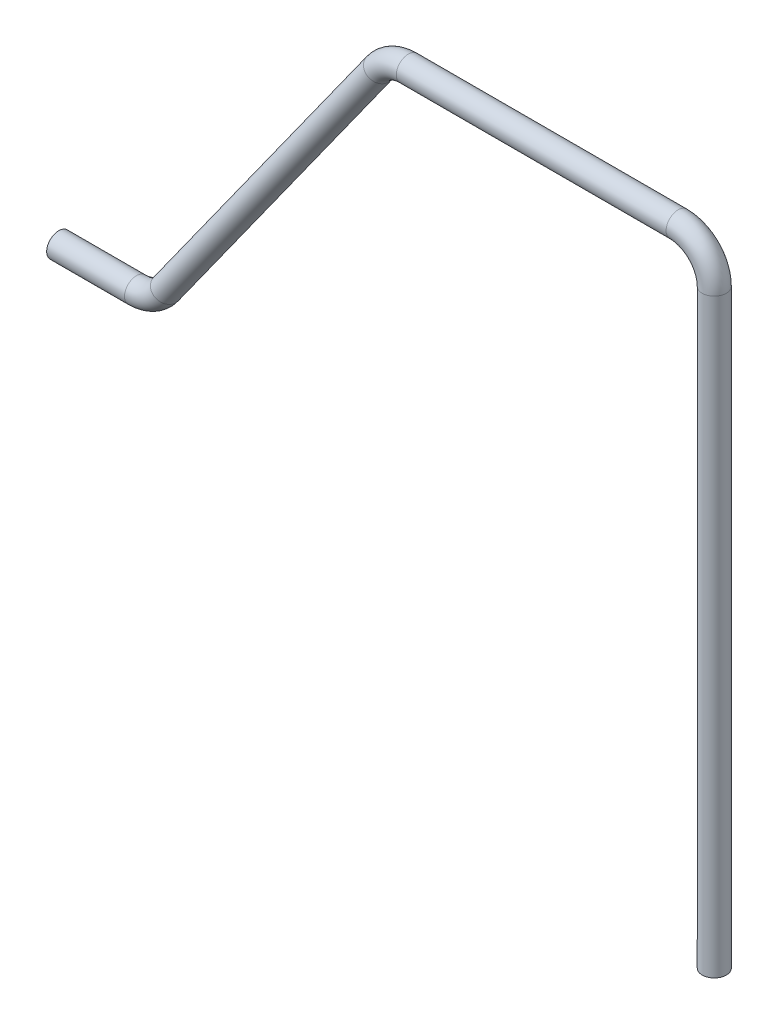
ISO-10303-21;
HEADER;
FILE_DESCRIPTION(('STEP AP214'),'2;1');
FILE_NAME('part.step','',(''),(''),'','','');
FILE_SCHEMA(('AUTOMOTIVE_DESIGN { 1 0 10303 214 1 1 1 1 }'));
ENDSEC;
DATA;
#1=APPLICATION_CONTEXT('core data for automotive mechanical design processes');
#2=APPLICATION_PROTOCOL_DEFINITION('international standard','automotive_design',2000,#1);
#3=PRODUCT_CONTEXT('',#1,'mechanical');
#4=PRODUCT('Part','Part','',(#3));
#5=PRODUCT_RELATED_PRODUCT_CATEGORY('part','',(#4));
#6=PRODUCT_DEFINITION_FORMATION('','',#4);
#7=PRODUCT_DEFINITION_CONTEXT('part definition',#1,'design');
#8=PRODUCT_DEFINITION('design','',#6,#7);
#9=PRODUCT_DEFINITION_SHAPE('','',#8);
#10=(LENGTH_UNIT() NAMED_UNIT(*) SI_UNIT(.MILLI.,.METRE.));
#11=(NAMED_UNIT(*) PLANE_ANGLE_UNIT() SI_UNIT($,.RADIAN.));
#12=(NAMED_UNIT(*) SI_UNIT($,.STERADIAN.) SOLID_ANGLE_UNIT());
#13=UNCERTAINTY_MEASURE_WITH_UNIT(LENGTH_MEASURE(1.E-05),#10,'distance_accuracy_value','');
#14=(GEOMETRIC_REPRESENTATION_CONTEXT(3) GLOBAL_UNCERTAINTY_ASSIGNED_CONTEXT((#13)) GLOBAL_UNIT_ASSIGNED_CONTEXT((#10,
#11,#12)) REPRESENTATION_CONTEXT('',''));
#15=CARTESIAN_POINT('',(0.,0.,0.));
#16=DIRECTION('',(0.,0.,1.));
#17=DIRECTION('',(1.,0.,0.));
#18=AXIS2_PLACEMENT_3D('',#15,#16,#17);
#19=CARTESIAN_POINT('',(86.36,38.4175,0.));
#20=DIRECTION('',(0.,-1.,0.));
#21=DIRECTION('',(1.,0.,0.));
#22=AXIS2_PLACEMENT_3D('',#19,#20,#21);
#23=CYLINDRICAL_SURFACE('',#22,1.5875);
#24=CARTESIAN_POINT('',(86.36,38.4175,0.));
#25=DIRECTION('',(0.,-1.,0.));
#26=DIRECTION('',(0.,0.,-1.));
#27=AXIS2_PLACEMENT_3D('',#24,#25,#26);
#28=CIRCLE('',#27,1.5875);
#29=CARTESIAN_POINT('',(87.9475,38.4175,0.));
#30=VERTEX_POINT('',#29);
#31=EDGE_CURVE('E38',#30,#30,#28,.T.);
#32=ORIENTED_EDGE('',*,*,#31,.T.);
#33=EDGE_LOOP('',(#32));
#34=FACE_BOUND('',#33,.T.);
#35=CARTESIAN_POINT('',(86.36,-39.37,0.));
#36=DIRECTION('',(0.,-1.,0.));
#37=DIRECTION('',(0.,0.,-1.));
#38=AXIS2_PLACEMENT_3D('',#35,#36,#37);
#39=CIRCLE('',#38,1.5875);
#40=CARTESIAN_POINT('',(86.36,-39.37,-1.5875));
#41=VERTEX_POINT('',#40);
#42=EDGE_CURVE('E10',#41,#41,#39,.T.);
#43=ORIENTED_EDGE('',*,*,#42,.F.);
#44=EDGE_LOOP('',(#43));
#45=FACE_BOUND('',#44,.T.);
#46=ADVANCED_FACE('F32',(#34,#45),#23,.T.);
#47=CARTESIAN_POINT('',(81.5975,38.4175,0.));
#48=DIRECTION('',(0.,0.,-1.));
#49=DIRECTION('',(-1.,0.,0.));
#50=AXIS2_PLACEMENT_3D('',#47,#48,#49);
#51=TOROIDAL_SURFACE('',#50,4.7625,1.5875);
#52=CARTESIAN_POINT('',(81.5975,43.18,0.));
#53=DIRECTION('',(1.,0.,0.));
#54=DIRECTION('',(0.,0.,-1.));
#55=AXIS2_PLACEMENT_3D('',#52,#53,#54);
#56=CIRCLE('',#55,1.5875);
#57=CARTESIAN_POINT('',(81.5975,44.7675,0.));
#58=VERTEX_POINT('',#57);
#59=EDGE_CURVE('E42',#58,#58,#56,.T.);
#60=CARTESIAN_POINT('',(81.5975,38.4175,0.));
#61=DIRECTION('',(0.,0.,-1.));
#62=DIRECTION('',(-1.,0.,0.));
#63=AXIS2_PLACEMENT_3D('',#60,#61,#62);
#64=CIRCLE('',#63,6.35);
#65=EDGE_CURVE('',#58,#30,#64,.T.);
#66=ORIENTED_EDGE('',*,*,#59,.T.);
#67=ORIENTED_EDGE('',*,*,#31,.F.);
#68=ORIENTED_EDGE('',*,*,#65,.T.);
#69=ORIENTED_EDGE('',*,*,#65,.F.);
#70=EDGE_LOOP('',(#66,#68,#67,#69));
#71=FACE_BOUND('',#70,.T.);
#72=ADVANCED_FACE('F82',(#71),#51,.T.);
#73=CARTESIAN_POINT('',(46.0573254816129,43.18,0.));
#74=DIRECTION('',(1.,0.,0.));
#75=DIRECTION('',(0.,1.,0.));
#76=AXIS2_PLACEMENT_3D('',#73,#74,#75);
#77=CYLINDRICAL_SURFACE('',#76,1.5875);
#78=CARTESIAN_POINT('',(46.0573254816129,43.18,0.));
#79=DIRECTION('',(1.,0.,0.));
#80=DIRECTION('',(0.,0.,-1.));
#81=AXIS2_PLACEMENT_3D('',#78,#79,#80);
#82=CIRCLE('',#81,1.5875);
#83=CARTESIAN_POINT('',(46.0573254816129,44.7675,0.));
#84=VERTEX_POINT('',#83);
#85=EDGE_CURVE('E46',#84,#84,#82,.T.);
#86=ORIENTED_EDGE('',*,*,#85,.T.);
#87=EDGE_LOOP('',(#86));
#88=FACE_BOUND('',#87,.T.);
#89=ORIENTED_EDGE('',*,*,#59,.F.);
#90=EDGE_LOOP('',(#89));
#91=FACE_BOUND('',#90,.T.);
#92=ADVANCED_FACE('F86',(#88,#91),#77,.T.);
#93=CARTESIAN_POINT('',(46.0573254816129,38.4175,0.));
#94=DIRECTION('',(0.,0.,-1.));
#95=DIRECTION('',(-1.,0.,0.));
#96=AXIS2_PLACEMENT_3D('',#93,#94,#95);
#97=TOROIDAL_SURFACE('',#96,4.7625,1.5875);
#98=CARTESIAN_POINT('',(42.1847501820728,41.1896051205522,0.));
#99=DIRECTION('',(0.582069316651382,0.813139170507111,0.));
#100=DIRECTION('',(0.,0.,-1.));
#101=AXIS2_PLACEMENT_3D('',#98,#99,#100);
#102=CIRCLE('',#101,1.5875);
#103=CARTESIAN_POINT('',(40.8938917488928,42.1136401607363,0.));
#104=VERTEX_POINT('',#103);
#105=EDGE_CURVE('E51',#104,#104,#102,.T.);
#106=CARTESIAN_POINT('',(46.0573254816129,38.4175,0.));
#107=DIRECTION('',(0.,0.,-1.));
#108=DIRECTION('',(-1.,0.,0.));
#109=AXIS2_PLACEMENT_3D('',#106,#107,#108);
#110=CIRCLE('',#109,6.35);
#111=EDGE_CURVE('',#104,#84,#110,.T.);
#112=ORIENTED_EDGE('',*,*,#105,.T.);
#113=ORIENTED_EDGE('',*,*,#85,.F.);
#114=ORIENTED_EDGE('',*,*,#111,.T.);
#115=ORIENTED_EDGE('',*,*,#111,.F.);
#116=EDGE_LOOP('',(#112,#114,#113,#115));
#117=FACE_BOUND('',#116,.T.);
#118=ADVANCED_FACE('F92',(#117),#97,.T.);
#119=CARTESIAN_POINT('',(14.1247841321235,1.9903948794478,0.));
#120=DIRECTION('',(0.582069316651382,0.813139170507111,0.));
#121=DIRECTION('',(-0.813139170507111,0.582069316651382,0.));
#122=AXIS2_PLACEMENT_3D('',#119,#120,#121);
#123=CYLINDRICAL_SURFACE('',#122,1.5875);
#124=CARTESIAN_POINT('',(14.1247841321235,1.9903948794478,0.));
#125=DIRECTION('',(0.582069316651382,0.813139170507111,0.));
#126=DIRECTION('',(0.,0.,-1.));
#127=AXIS2_PLACEMENT_3D('',#124,#125,#126);
#128=CIRCLE('',#127,1.5875);
#129=CARTESIAN_POINT('',(15.4156425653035,1.06635983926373,0.));
#130=VERTEX_POINT('',#129);
#131=EDGE_CURVE('E54',#130,#130,#128,.T.);
#132=ORIENTED_EDGE('',*,*,#131,.T.);
#133=EDGE_LOOP('',(#132));
#134=FACE_BOUND('',#133,.T.);
#135=ORIENTED_EDGE('',*,*,#105,.F.);
#136=EDGE_LOOP('',(#135));
#137=FACE_BOUND('',#136,.T.);
#138=ADVANCED_FACE('F99',(#134,#137),#123,.T.);
#139=CARTESIAN_POINT('',(10.2522088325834,4.7625,0.));
#140=DIRECTION('',(0.,0.,1.));
#141=DIRECTION('',(1.,0.,0.));
#142=AXIS2_PLACEMENT_3D('',#139,#140,#141);
#143=TOROIDAL_SURFACE('',#142,4.7625,1.5875);
#144=CARTESIAN_POINT('',(10.2522088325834,0.,0.));
#145=DIRECTION('',(1.,0.,0.));
#146=DIRECTION('',(0.,0.,-1.));
#147=AXIS2_PLACEMENT_3D('',#144,#145,#146);
#148=CIRCLE('',#147,1.5875);
#149=CARTESIAN_POINT('',(10.2522088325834,-1.5875,0.));
#150=VERTEX_POINT('',#149);
#151=EDGE_CURVE('E57',#150,#150,#148,.T.);
#152=CARTESIAN_POINT('',(10.2522088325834,4.7625,0.));
#153=DIRECTION('',(0.,0.,1.));
#154=DIRECTION('',(1.,0.,0.));
#155=AXIS2_PLACEMENT_3D('',#152,#153,#154);
#156=CIRCLE('',#155,6.35);
#157=EDGE_CURVE('',#150,#130,#156,.T.);
#158=ORIENTED_EDGE('',*,*,#151,.T.);
#159=ORIENTED_EDGE('',*,*,#131,.F.);
#160=ORIENTED_EDGE('',*,*,#157,.T.);
#161=ORIENTED_EDGE('',*,*,#157,.F.);
#162=EDGE_LOOP('',(#158,#160,#159,#161));
#163=FACE_BOUND('',#162,.T.);
#164=ADVANCED_FACE('F64',(#163),#143,.T.);
#165=CARTESIAN_POINT('',(10.2522088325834,0.,0.));
#166=DIRECTION('',(-1.,0.,0.));
#167=DIRECTION('',(0.,-1.,0.));
#168=AXIS2_PLACEMENT_3D('',#165,#166,#167);
#169=CYLINDRICAL_SURFACE('',#168,1.5875);
#170=ORIENTED_EDGE('',*,*,#151,.F.);
#171=EDGE_LOOP('',(#170));
#172=FACE_BOUND('',#171,.T.);
#173=CARTESIAN_POINT('',(0.,0.,0.));
#174=DIRECTION('',(1.,0.,0.));
#175=DIRECTION('',(0.,0.,-1.));
#176=AXIS2_PLACEMENT_3D('',#173,#174,#175);
#177=CIRCLE('',#176,1.5875);
#178=CARTESIAN_POINT('',(0.,0.,-1.5875));
#179=VERTEX_POINT('',#178);
#180=EDGE_CURVE('E58',#179,#179,#177,.T.);
#181=ORIENTED_EDGE('',*,*,#180,.T.);
#182=EDGE_LOOP('',(#181));
#183=FACE_BOUND('',#182,.T.);
#184=ADVANCED_FACE('F67',(#172,#183),#169,.T.);
#185=CARTESIAN_POINT('',(86.36,-39.37,0.));
#186=DIRECTION('',(0.,-1.,0.));
#187=DIRECTION('',(0.,0.,-1.));
#188=AXIS2_PLACEMENT_3D('',#185,#186,#187);
#189=PLANE('',#188);
#190=ORIENTED_EDGE('',*,*,#42,.T.);
#191=EDGE_LOOP('',(#190));
#192=FACE_BOUND('',#191,.T.);
#193=ADVANCED_FACE('F70',(#192),#189,.T.);
#194=CARTESIAN_POINT('',(0.,0.,0.));
#195=DIRECTION('',(1.,0.,0.));
#196=DIRECTION('',(0.,0.,-1.));
#197=AXIS2_PLACEMENT_3D('',#194,#195,#196);
#198=PLANE('',#197);
#199=ORIENTED_EDGE('',*,*,#180,.F.);
#200=EDGE_LOOP('',(#199));
#201=FACE_BOUND('',#200,.T.);
#202=ADVANCED_FACE('F74',(#201),#198,.F.);
#203=CLOSED_SHELL('',(#46,#72,#92,#118,#138,#164,#184,#193,#202));
#204=MANIFOLD_SOLID_BREP('B2',#203);
#205=ADVANCED_BREP_SHAPE_REPRESENTATION('',(#18,#204),#14);
#206=SHAPE_DEFINITION_REPRESENTATION(#9,#205);
ENDSEC;
END-ISO-10303-21;
